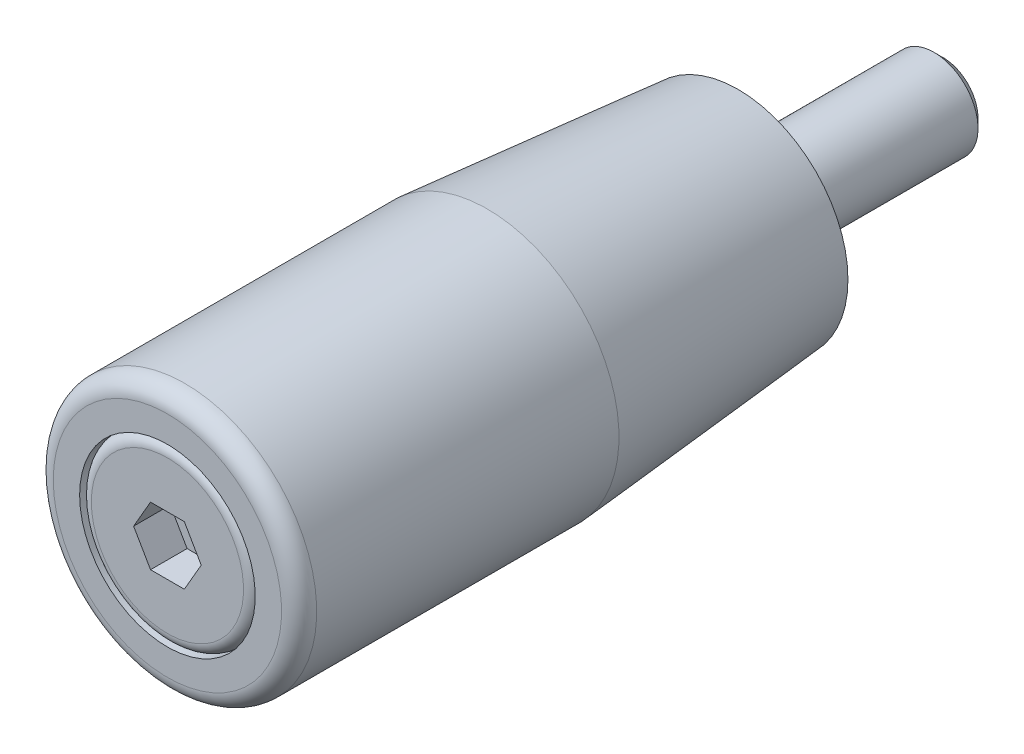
ISO-10303-21;
HEADER;
FILE_DESCRIPTION(('STEP AP214'),'2;1');
FILE_NAME('part.step','',(''),(''),'','','');
FILE_SCHEMA(('AUTOMOTIVE_DESIGN { 1 0 10303 214 1 1 1 1 }'));
ENDSEC;
DATA;
#1=APPLICATION_CONTEXT('core data for automotive mechanical design processes');
#2=APPLICATION_PROTOCOL_DEFINITION('international standard','automotive_design',2000,#1);
#3=PRODUCT_CONTEXT('',#1,'mechanical');
#4=PRODUCT('Part','Part','',(#3));
#5=PRODUCT_RELATED_PRODUCT_CATEGORY('part','',(#4));
#6=PRODUCT_DEFINITION_FORMATION('','',#4);
#7=PRODUCT_DEFINITION_CONTEXT('part definition',#1,'design');
#8=PRODUCT_DEFINITION('design','',#6,#7);
#9=PRODUCT_DEFINITION_SHAPE('','',#8);
#10=(LENGTH_UNIT() NAMED_UNIT(*) SI_UNIT(.MILLI.,.METRE.));
#11=(NAMED_UNIT(*) PLANE_ANGLE_UNIT() SI_UNIT($,.RADIAN.));
#12=(NAMED_UNIT(*) SI_UNIT($,.STERADIAN.) SOLID_ANGLE_UNIT());
#13=UNCERTAINTY_MEASURE_WITH_UNIT(LENGTH_MEASURE(1.E-05),#10,'distance_accuracy_value','');
#14=(GEOMETRIC_REPRESENTATION_CONTEXT(3) GLOBAL_UNCERTAINTY_ASSIGNED_CONTEXT((#13)) GLOBAL_UNIT_ASSIGNED_CONTEXT((#10,
#11,#12)) REPRESENTATION_CONTEXT('',''));
#15=CARTESIAN_POINT('',(0.,0.,0.));
#16=DIRECTION('',(0.,0.,1.));
#17=DIRECTION('',(1.,0.,0.));
#18=AXIS2_PLACEMENT_3D('',#15,#16,#17);
#19=CARTESIAN_POINT('',(0.,-2.,0.));
#20=DIRECTION('',(0.,0.,1.));
#21=DIRECTION('',(-1.,0.,0.));
#22=AXIS2_PLACEMENT_3D('',#19,#20,#21);
#23=PLANE('',#22);
#24=CARTESIAN_POINT('',(0.,0.,0.));
#25=DIRECTION('',(0.,0.,1.));
#26=DIRECTION('',(-1.,0.,0.));
#27=AXIS2_PLACEMENT_3D('',#24,#25,#26);
#28=CIRCLE('',#27,4.);
#29=CARTESIAN_POINT('',(-4.,0.,0.));
#30=VERTEX_POINT('',#29);
#31=EDGE_CURVE('E121',#30,#30,#28,.T.);
#32=ORIENTED_EDGE('',*,*,#31,.F.);
#33=EDGE_LOOP('',(#32));
#34=FACE_BOUND('',#33,.T.);
#35=CARTESIAN_POINT('',(0.,0.,0.));
#36=DIRECTION('',(0.,0.,1.));
#37=DIRECTION('',(-1.,0.,0.));
#38=AXIS2_PLACEMENT_3D('',#35,#36,#37);
#39=CIRCLE('',#38,2.);
#40=CARTESIAN_POINT('',(-2.,0.,0.));
#41=VERTEX_POINT('',#40);
#42=EDGE_CURVE('E124',#41,#41,#39,.T.);
#43=ORIENTED_EDGE('',*,*,#42,.T.);
#44=EDGE_LOOP('',(#43));
#45=FACE_BOUND('',#44,.T.);
#46=ADVANCED_FACE('F15',(#34,#45),#23,.F.);
#47=CARTESIAN_POINT('',(0.,-2.7931850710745E-13,40.));
#48=DIRECTION('',(0.,0.,1.));
#49=DIRECTION('',(-1.,0.,0.));
#50=AXIS2_PLACEMENT_3D('',#47,#48,#49);
#51=CYLINDRICAL_SURFACE('',#50,2.);
#52=ORIENTED_EDGE('',*,*,#42,.F.);
#53=EDGE_LOOP('',(#52));
#54=FACE_BOUND('',#53,.T.);
#55=CARTESIAN_POINT('',(0.,0.,-1.5));
#56=DIRECTION('',(0.,0.,1.));
#57=DIRECTION('',(-1.,0.,0.));
#58=AXIS2_PLACEMENT_3D('',#55,#56,#57);
#59=CIRCLE('',#58,2.);
#60=CARTESIAN_POINT('',(-2.,0.,-1.5));
#61=VERTEX_POINT('',#60);
#62=EDGE_CURVE('E127',#61,#61,#59,.T.);
#63=ORIENTED_EDGE('',*,*,#62,.T.);
#64=EDGE_LOOP('',(#63));
#65=FACE_BOUND('',#64,.T.);
#66=ADVANCED_FACE('F246',(#54,#65),#51,.T.);
#67=CARTESIAN_POINT('',(0.,-2.3865,-1.5));
#68=DIRECTION('',(0.,0.,-1.));
#69=DIRECTION('',(1.,0.,0.));
#70=AXIS2_PLACEMENT_3D('',#67,#68,#69);
#71=PLANE('',#70);
#72=ORIENTED_EDGE('',*,*,#62,.F.);
#73=EDGE_LOOP('',(#72));
#74=FACE_BOUND('',#73,.T.);
#75=CARTESIAN_POINT('',(0.,0.,-1.5));
#76=DIRECTION('',(0.,0.,1.));
#77=DIRECTION('',(-1.,0.,0.));
#78=AXIS2_PLACEMENT_3D('',#75,#76,#77);
#79=CIRCLE('',#78,2.3865);
#80=CARTESIAN_POINT('',(-2.3865,0.,-1.5));
#81=VERTEX_POINT('',#80);
#82=EDGE_CURVE('E130',#81,#81,#79,.T.);
#83=ORIENTED_EDGE('',*,*,#82,.T.);
#84=EDGE_LOOP('',(#83));
#85=FACE_BOUND('',#84,.T.);
#86=ADVANCED_FACE('F242',(#74,#85),#71,.F.);
#87=CARTESIAN_POINT('',(0.,0.,-2.1135));
#88=DIRECTION('',(0.,0.,-1.));
#89=DIRECTION('',(1.,0.,0.));
#90=AXIS2_PLACEMENT_3D('',#87,#88,#89);
#91=CONICAL_SURFACE('',#90,3.,0.785398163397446);
#92=ORIENTED_EDGE('',*,*,#82,.F.);
#93=EDGE_LOOP('',(#92));
#94=FACE_BOUND('',#93,.T.);
#95=CARTESIAN_POINT('',(0.,0.,-2.1135));
#96=DIRECTION('',(0.,0.,1.));
#97=DIRECTION('',(-1.,0.,0.));
#98=AXIS2_PLACEMENT_3D('',#95,#96,#97);
#99=CIRCLE('',#98,3.);
#100=CARTESIAN_POINT('',(-3.,0.,-2.1135));
#101=VERTEX_POINT('',#100);
#102=EDGE_CURVE('E133',#101,#101,#99,.T.);
#103=ORIENTED_EDGE('',*,*,#102,.T.);
#104=EDGE_LOOP('',(#103));
#105=FACE_BOUND('',#104,.T.);
#106=ADVANCED_FACE('F238',(#94,#105),#91,.T.);
#107=CARTESIAN_POINT('',(0.,-2.7931850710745E-13,40.));
#108=DIRECTION('',(0.,0.,1.));
#109=DIRECTION('',(-1.,0.,0.));
#110=AXIS2_PLACEMENT_3D('',#107,#108,#109);
#111=CYLINDRICAL_SURFACE('',#110,3.);
#112=ORIENTED_EDGE('',*,*,#102,.F.);
#113=EDGE_LOOP('',(#112));
#114=FACE_BOUND('',#113,.T.);
#115=CARTESIAN_POINT('',(0.,0.,-12.3865));
#116=DIRECTION('',(0.,0.,1.));
#117=DIRECTION('',(-1.,0.,0.));
#118=AXIS2_PLACEMENT_3D('',#115,#116,#117);
#119=CIRCLE('',#118,3.);
#120=CARTESIAN_POINT('',(-3.,0.,-12.3865));
#121=VERTEX_POINT('',#120);
#122=EDGE_CURVE('E136',#121,#121,#119,.T.);
#123=ORIENTED_EDGE('',*,*,#122,.T.);
#124=EDGE_LOOP('',(#123));
#125=FACE_BOUND('',#124,.T.);
#126=ADVANCED_FACE('F234',(#114,#125),#111,.T.);
#127=CARTESIAN_POINT('',(0.,0.,-13.));
#128=DIRECTION('',(0.,0.,1.));
#129=DIRECTION('',(-1.,0.,0.));
#130=AXIS2_PLACEMENT_3D('',#127,#128,#129);
#131=CONICAL_SURFACE('',#130,2.3865,0.785398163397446);
#132=ORIENTED_EDGE('',*,*,#122,.F.);
#133=EDGE_LOOP('',(#132));
#134=FACE_BOUND('',#133,.T.);
#135=CARTESIAN_POINT('',(0.,0.,-13.));
#136=DIRECTION('',(0.,0.,1.));
#137=DIRECTION('',(-1.,0.,0.));
#138=AXIS2_PLACEMENT_3D('',#135,#136,#137);
#139=CIRCLE('',#138,2.3865);
#140=CARTESIAN_POINT('',(-2.3865,0.,-13.));
#141=VERTEX_POINT('',#140);
#142=EDGE_CURVE('E139',#141,#141,#139,.T.);
#143=ORIENTED_EDGE('',*,*,#142,.T.);
#144=EDGE_LOOP('',(#143));
#145=FACE_BOUND('',#144,.T.);
#146=ADVANCED_FACE('F230',(#134,#145),#131,.T.);
#147=CARTESIAN_POINT('',(0.,0.,-13.));
#148=DIRECTION('',(0.,0.,1.));
#149=DIRECTION('',(-1.,0.,0.));
#150=AXIS2_PLACEMENT_3D('',#147,#148,#149);
#151=PLANE('',#150);
#152=ORIENTED_EDGE('',*,*,#142,.F.);
#153=EDGE_LOOP('',(#152));
#154=FACE_BOUND('',#153,.T.);
#155=ADVANCED_FACE('F202',(#154),#151,.F.);
#156=CARTESIAN_POINT('',(0.,-2.7931850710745E-13,40.));
#157=DIRECTION('',(0.,0.,1.));
#158=DIRECTION('',(-1.,0.,0.));
#159=AXIS2_PLACEMENT_3D('',#156,#157,#158);
#160=CYLINDRICAL_SURFACE('',#159,4.);
#161=CARTESIAN_POINT('',(0.,0.,1.));
#162=DIRECTION('',(0.,0.,-1.));
#163=DIRECTION('',(1.,0.,0.));
#164=AXIS2_PLACEMENT_3D('',#161,#162,#163);
#165=CIRCLE('',#164,4.);
#166=CARTESIAN_POINT('',(4.,0.,1.));
#167=VERTEX_POINT('',#166);
#168=EDGE_CURVE('E9',#167,#167,#165,.T.);
#169=ORIENTED_EDGE('',*,*,#168,.T.);
#170=EDGE_LOOP('',(#169));
#171=FACE_BOUND('',#170,.T.);
#172=ORIENTED_EDGE('',*,*,#31,.T.);
#173=EDGE_LOOP('',(#172));
#174=FACE_BOUND('',#173,.T.);
#175=ADVANCED_FACE('F194',(#171,#174),#160,.T.);
#176=CARTESIAN_POINT('',(0.,-2.7931850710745E-13,40.));
#177=DIRECTION('',(0.,0.,1.));
#178=DIRECTION('',(-1.,0.,0.));
#179=AXIS2_PLACEMENT_3D('',#176,#177,#178);
#180=CYLINDRICAL_SURFACE('',#179,6.);
#181=CARTESIAN_POINT('',(0.,-2.7931850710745E-13,40.));
#182=DIRECTION('',(0.,0.,1.));
#183=DIRECTION('',(-1.,0.,0.));
#184=AXIS2_PLACEMENT_3D('',#181,#182,#183);
#185=CIRCLE('',#184,6.);
#186=CARTESIAN_POINT('',(-6.,-2.7931850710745E-13,40.));
#187=VERTEX_POINT('',#186);
#188=EDGE_CURVE('E167',#187,#187,#185,.T.);
#189=ORIENTED_EDGE('',*,*,#188,.T.);
#190=EDGE_LOOP('',(#189));
#191=FACE_BOUND('',#190,.T.);
#192=CARTESIAN_POINT('',(0.,-2.73732136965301E-13,39.2));
#193=DIRECTION('',(0.,0.,1.));
#194=DIRECTION('',(-1.,0.,0.));
#195=AXIS2_PLACEMENT_3D('',#192,#193,#194);
#196=CIRCLE('',#195,6.);
#197=CARTESIAN_POINT('',(-6.,-2.73732136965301E-13,39.2));
#198=VERTEX_POINT('',#197);
#199=EDGE_CURVE('E112',#198,#198,#196,.T.);
#200=ORIENTED_EDGE('',*,*,#199,.F.);
#201=EDGE_LOOP('',(#200));
#202=FACE_BOUND('',#201,.T.);
#203=ADVANCED_FACE('F180',(#191,#202),#180,.F.);
#204=CARTESIAN_POINT('',(0.,-6.00000000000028,40.));
#205=DIRECTION('',(0.,0.,1.));
#206=DIRECTION('',(-1.,0.,0.));
#207=AXIS2_PLACEMENT_3D('',#204,#205,#206);
#208=PLANE('',#207);
#209=CARTESIAN_POINT('',(0.,-2.7931850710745E-13,40.));
#210=DIRECTION('',(0.,0.,1.));
#211=DIRECTION('',(-1.,0.,0.));
#212=AXIS2_PLACEMENT_3D('',#209,#210,#211);
#213=CIRCLE('',#212,7.8);
#214=CARTESIAN_POINT('',(-7.8,-2.7931850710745E-13,40.));
#215=VERTEX_POINT('',#214);
#216=EDGE_CURVE('E165',#215,#215,#213,.T.);
#217=ORIENTED_EDGE('',*,*,#216,.T.);
#218=EDGE_LOOP('',(#217));
#219=FACE_BOUND('',#218,.T.);
#220=ORIENTED_EDGE('',*,*,#188,.F.);
#221=EDGE_LOOP('',(#220));
#222=FACE_BOUND('',#221,.T.);
#223=ADVANCED_FACE('F211',(#219,#222),#208,.T.);
#224=CARTESIAN_POINT('',(0.,-2.70938951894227E-13,38.8));
#225=DIRECTION('',(0.,0.,1.));
#226=DIRECTION('',(-1.,0.,0.));
#227=AXIS2_PLACEMENT_3D('',#224,#225,#226);
#228=TOROIDAL_SURFACE('',#227,7.8,1.2);
#229=CARTESIAN_POINT('',(0.,-2.70938951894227E-13,38.8));
#230=DIRECTION('',(0.,0.,1.));
#231=DIRECTION('',(-1.,0.,0.));
#232=AXIS2_PLACEMENT_3D('',#229,#230,#231);
#233=CIRCLE('',#232,9.);
#234=CARTESIAN_POINT('',(-9.,-2.70938951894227E-13,38.8));
#235=VERTEX_POINT('',#234);
#236=EDGE_CURVE('E162',#235,#235,#233,.T.);
#237=ORIENTED_EDGE('',*,*,#236,.T.);
#238=EDGE_LOOP('',(#237));
#239=FACE_BOUND('',#238,.T.);
#240=ORIENTED_EDGE('',*,*,#216,.F.);
#241=EDGE_LOOP('',(#240));
#242=FACE_BOUND('',#241,.T.);
#243=ADVANCED_FACE('F214',(#239,#242),#228,.T.);
#244=CARTESIAN_POINT('',(0.,-7.5,0.999999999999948));
#245=DIRECTION('',(0.,0.,-1.));
#246=DIRECTION('',(1.,0.,0.));
#247=AXIS2_PLACEMENT_3D('',#244,#245,#246);
#248=PLANE('',#247);
#249=ORIENTED_EDGE('',*,*,#168,.F.);
#250=EDGE_LOOP('',(#249));
#251=FACE_BOUND('',#250,.T.);
#252=CARTESIAN_POINT('',(0.,0.,1.));
#253=DIRECTION('',(0.,0.,1.));
#254=DIRECTION('',(-1.,0.,0.));
#255=AXIS2_PLACEMENT_3D('',#252,#253,#254);
#256=CIRCLE('',#255,7.5);
#257=CARTESIAN_POINT('',(-7.5,0.,1.));
#258=VERTEX_POINT('',#257);
#259=EDGE_CURVE('E156',#258,#258,#256,.T.);
#260=ORIENTED_EDGE('',*,*,#259,.F.);
#261=EDGE_LOOP('',(#260));
#262=FACE_BOUND('',#261,.T.);
#263=ADVANCED_FACE('F17',(#251,#262),#248,.T.);
#264=CARTESIAN_POINT('',(0.,-1.26706405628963E-13,18.145078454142));
#265=DIRECTION('',(0.,0.,1.));
#266=DIRECTION('',(-1.,0.,0.));
#267=AXIS2_PLACEMENT_3D('',#264,#265,#266);
#268=CONICAL_SURFACE('',#267,9.,0.0872664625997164);
#269=ORIENTED_EDGE('',*,*,#259,.T.);
#270=EDGE_LOOP('',(#269));
#271=FACE_BOUND('',#270,.T.);
#272=CARTESIAN_POINT('',(0.,-1.26706405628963E-13,18.145078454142));
#273=DIRECTION('',(0.,0.,1.));
#274=DIRECTION('',(-1.,0.,0.));
#275=AXIS2_PLACEMENT_3D('',#272,#273,#274);
#276=CIRCLE('',#275,9.);
#277=CARTESIAN_POINT('',(-9.,-1.26706405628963E-13,18.145078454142));
#278=VERTEX_POINT('',#277);
#279=EDGE_CURVE('E159',#278,#278,#276,.T.);
#280=ORIENTED_EDGE('',*,*,#279,.F.);
#281=EDGE_LOOP('',(#280));
#282=FACE_BOUND('',#281,.T.);
#283=ADVANCED_FACE('F223',(#271,#282),#268,.T.);
#284=CARTESIAN_POINT('',(0.,-2.7931850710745E-13,40.));
#285=DIRECTION('',(0.,0.,1.));
#286=DIRECTION('',(-1.,0.,0.));
#287=AXIS2_PLACEMENT_3D('',#284,#285,#286);
#288=CYLINDRICAL_SURFACE('',#287,9.);
#289=ORIENTED_EDGE('',*,*,#279,.T.);
#290=EDGE_LOOP('',(#289));
#291=FACE_BOUND('',#290,.T.);
#292=ORIENTED_EDGE('',*,*,#236,.F.);
#293=EDGE_LOOP('',(#292));
#294=FACE_BOUND('',#293,.T.);
#295=ADVANCED_FACE('F219',(#291,#294),#288,.T.);
#296=CARTESIAN_POINT('',(0.,-2.73732136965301E-13,39.2));
#297=DIRECTION('',(0.,0.,1.));
#298=DIRECTION('',(-1.,0.,0.));
#299=AXIS2_PLACEMENT_3D('',#296,#297,#298);
#300=TOROIDAL_SURFACE('',#299,5.2,0.799999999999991);
#301=ORIENTED_EDGE('',*,*,#199,.T.);
#302=EDGE_LOOP('',(#301));
#303=FACE_BOUND('',#302,.T.);
#304=CARTESIAN_POINT('',(0.,-2.7931850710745E-13,40.));
#305=DIRECTION('',(0.,0.,1.));
#306=DIRECTION('',(-1.,0.,0.));
#307=AXIS2_PLACEMENT_3D('',#304,#305,#306);
#308=CIRCLE('',#307,5.2);
#309=CARTESIAN_POINT('',(-5.2,-2.7931850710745E-13,40.));
#310=VERTEX_POINT('',#309);
#311=EDGE_CURVE('E85',#310,#310,#308,.T.);
#312=ORIENTED_EDGE('',*,*,#311,.F.);
#313=EDGE_LOOP('',(#312));
#314=FACE_BOUND('',#313,.T.);
#315=ADVANCED_FACE('F222',(#303,#314),#300,.T.);
#316=CARTESIAN_POINT('',(0.,-5.20000000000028,40.));
#317=DIRECTION('',(0.,0.,-1.));
#318=DIRECTION('',(1.,0.,0.));
#319=AXIS2_PLACEMENT_3D('',#316,#317,#318);
#320=PLANE('',#319);
#321=DIRECTION('',(1.,0.,0.));
#322=VECTOR('',#321,1.);
#323=CARTESIAN_POINT('',(0.,-2.00000000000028,40.));
#324=LINE('',#323,#322);
#325=CARTESIAN_POINT('',(-1.15470053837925,-2.00000000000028,40.));
#326=VERTEX_POINT('',#325);
#327=CARTESIAN_POINT('',(1.15470053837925,-2.00000000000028,40.));
#328=VERTEX_POINT('',#327);
#329=EDGE_CURVE('E146',#326,#328,#324,.T.);
#330=ORIENTED_EDGE('',*,*,#329,.F.);
#331=DIRECTION('',(0.5,-0.866025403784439,0.));
#332=VECTOR('',#331,1.);
#333=CARTESIAN_POINT('',(0.519615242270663,-4.90000000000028,40.));
#334=LINE('',#333,#332);
#335=CARTESIAN_POINT('',(-2.30940107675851,-2.7931850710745E-13,40.));
#336=VERTEX_POINT('',#335);
#337=EDGE_CURVE('E148',#336,#326,#334,.T.);
#338=ORIENTED_EDGE('',*,*,#337,.F.);
#339=DIRECTION('',(-0.5,-0.866025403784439,0.));
#340=VECTOR('',#339,1.);
#341=CARTESIAN_POINT('',(-3.98371685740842,-2.90000000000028,40.));
#342=LINE('',#341,#340);
#343=CARTESIAN_POINT('',(-1.15470053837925,1.99999999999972,40.));
#344=VERTEX_POINT('',#343);
#345=EDGE_CURVE('E151',#344,#336,#342,.T.);
#346=ORIENTED_EDGE('',*,*,#345,.F.);
#347=DIRECTION('',(-1.,0.,0.));
#348=VECTOR('',#347,1.);
#349=CARTESIAN_POINT('',(0.,1.99999999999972,40.));
#350=LINE('',#349,#348);
#351=CARTESIAN_POINT('',(1.15470053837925,1.99999999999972,40.));
#352=VERTEX_POINT('',#351);
#353=EDGE_CURVE('E41',#352,#344,#350,.T.);
#354=ORIENTED_EDGE('',*,*,#353,.F.);
#355=DIRECTION('',(-0.5,0.866025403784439,0.));
#356=VECTOR('',#355,1.);
#357=CARTESIAN_POINT('',(3.98371685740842,-2.90000000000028,40.));
#358=LINE('',#357,#356);
#359=CARTESIAN_POINT('',(2.30940107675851,-2.7931850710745E-13,40.));
#360=VERTEX_POINT('',#359);
#361=EDGE_CURVE('E142',#360,#352,#358,.T.);
#362=ORIENTED_EDGE('',*,*,#361,.F.);
#363=DIRECTION('',(0.5,0.866025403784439,0.));
#364=VECTOR('',#363,1.);
#365=CARTESIAN_POINT('',(-0.519615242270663,-4.90000000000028,40.));
#366=LINE('',#365,#364);
#367=EDGE_CURVE('E144',#328,#360,#366,.T.);
#368=ORIENTED_EDGE('',*,*,#367,.F.);
#369=EDGE_LOOP('',(#330,#338,#346,#354,#362,#368));
#370=FACE_BOUND('',#369,.T.);
#371=ORIENTED_EDGE('',*,*,#311,.T.);
#372=EDGE_LOOP('',(#371));
#373=FACE_BOUND('',#372,.T.);
#374=ADVANCED_FACE('F273',(#370,#373),#320,.F.);
#375=CARTESIAN_POINT('',(-1.15470053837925,-2.00000000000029,42.5));
#376=DIRECTION('',(0.,1.,0.));
#377=DIRECTION('',(-1.,0.,0.));
#378=AXIS2_PLACEMENT_3D('',#375,#376,#377);
#379=PLANE('',#378);
#380=DIRECTION('',(0.,0.,-1.));
#381=VECTOR('',#380,1.);
#382=CARTESIAN_POINT('',(-1.15470053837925,-2.00000000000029,42.5));
#383=LINE('',#382,#381);
#384=CARTESIAN_POINT('',(-1.15470053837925,-2.00000000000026,37.5));
#385=VERTEX_POINT('',#384);
#386=EDGE_CURVE('E106',#326,#385,#383,.T.);
#387=ORIENTED_EDGE('',*,*,#386,.F.);
#388=ORIENTED_EDGE('',*,*,#329,.T.);
#389=DIRECTION('',(0.,0.,-1.));
#390=VECTOR('',#389,1.);
#391=CARTESIAN_POINT('',(1.15470053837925,-2.00000000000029,42.5));
#392=LINE('',#391,#390);
#393=CARTESIAN_POINT('',(1.15470053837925,-2.00000000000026,37.5));
#394=VERTEX_POINT('',#393);
#395=EDGE_CURVE('E103',#328,#394,#392,.T.);
#396=ORIENTED_EDGE('',*,*,#395,.T.);
#397=DIRECTION('',(1.,0.,0.));
#398=VECTOR('',#397,1.);
#399=CARTESIAN_POINT('',(-1.15470053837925,-2.00000000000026,37.5));
#400=LINE('',#399,#398);
#401=EDGE_CURVE('E93',#385,#394,#400,.T.);
#402=ORIENTED_EDGE('',*,*,#401,.F.);
#403=EDGE_LOOP('',(#387,#388,#396,#402));
#404=FACE_BOUND('',#403,.T.);
#405=ADVANCED_FACE('F269',(#404),#379,.T.);
#406=CARTESIAN_POINT('',(-2.30940107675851,-2.96775913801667E-13,42.5));
#407=DIRECTION('',(0.866025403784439,0.5,0.));
#408=DIRECTION('',(-0.5,0.866025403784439,0.));
#409=AXIS2_PLACEMENT_3D('',#406,#407,#408);
#410=PLANE('',#409);
#411=ORIENTED_EDGE('',*,*,#337,.T.);
#412=ORIENTED_EDGE('',*,*,#386,.T.);
#413=DIRECTION('',(0.5,-0.866025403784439,0.));
#414=VECTOR('',#413,1.);
#415=CARTESIAN_POINT('',(-2.30940107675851,-2.61861100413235E-13,37.5));
#416=LINE('',#415,#414);
#417=CARTESIAN_POINT('',(-2.30940107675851,-2.61861100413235E-13,37.5));
#418=VERTEX_POINT('',#417);
#419=EDGE_CURVE('E91',#418,#385,#416,.T.);
#420=ORIENTED_EDGE('',*,*,#419,.F.);
#421=DIRECTION('',(0.,0.,-1.));
#422=VECTOR('',#421,1.);
#423=CARTESIAN_POINT('',(-2.30940107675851,-2.96775913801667E-13,42.5));
#424=LINE('',#423,#422);
#425=EDGE_CURVE('E86',#336,#418,#424,.T.);
#426=ORIENTED_EDGE('',*,*,#425,.F.);
#427=EDGE_LOOP('',(#411,#412,#420,#426));
#428=FACE_BOUND('',#427,.T.);
#429=ADVANCED_FACE('F272',(#428),#410,.T.);
#430=CARTESIAN_POINT('',(-1.15470053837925,1.99999999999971,42.5));
#431=DIRECTION('',(0.866025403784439,-0.5,0.));
#432=DIRECTION('',(0.5,0.866025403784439,0.));
#433=AXIS2_PLACEMENT_3D('',#430,#431,#432);
#434=PLANE('',#433);
#435=ORIENTED_EDGE('',*,*,#345,.T.);
#436=ORIENTED_EDGE('',*,*,#425,.T.);
#437=DIRECTION('',(-0.5,-0.866025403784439,0.));
#438=VECTOR('',#437,1.);
#439=CARTESIAN_POINT('',(-1.15470053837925,1.99999999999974,37.5));
#440=LINE('',#439,#438);
#441=CARTESIAN_POINT('',(-1.15470053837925,1.99999999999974,37.5));
#442=VERTEX_POINT('',#441);
#443=EDGE_CURVE('E76',#442,#418,#440,.T.);
#444=ORIENTED_EDGE('',*,*,#443,.F.);
#445=DIRECTION('',(0.,0.,-1.));
#446=VECTOR('',#445,1.);
#447=CARTESIAN_POINT('',(-1.15470053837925,1.99999999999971,42.5));
#448=LINE('',#447,#446);
#449=EDGE_CURVE('E81',#344,#442,#448,.T.);
#450=ORIENTED_EDGE('',*,*,#449,.F.);
#451=EDGE_LOOP('',(#435,#436,#444,#450));
#452=FACE_BOUND('',#451,.T.);
#453=ADVANCED_FACE('F88',(#452),#434,.T.);
#454=CARTESIAN_POINT('',(1.15470053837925,1.99999999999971,42.5));
#455=DIRECTION('',(0.,-1.,0.));
#456=DIRECTION('',(1.,0.,0.));
#457=AXIS2_PLACEMENT_3D('',#454,#455,#456);
#458=PLANE('',#457);
#459=ORIENTED_EDGE('',*,*,#353,.T.);
#460=ORIENTED_EDGE('',*,*,#449,.T.);
#461=DIRECTION('',(-1.,0.,0.));
#462=VECTOR('',#461,1.);
#463=CARTESIAN_POINT('',(1.15470053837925,1.99999999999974,37.5));
#464=LINE('',#463,#462);
#465=CARTESIAN_POINT('',(1.15470053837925,1.99999999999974,37.5));
#466=VERTEX_POINT('',#465);
#467=EDGE_CURVE('E73',#466,#442,#464,.T.);
#468=ORIENTED_EDGE('',*,*,#467,.F.);
#469=DIRECTION('',(0.,0.,-1.));
#470=VECTOR('',#469,1.);
#471=CARTESIAN_POINT('',(1.15470053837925,1.99999999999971,42.5));
#472=LINE('',#471,#470);
#473=EDGE_CURVE('E100',#352,#466,#472,.T.);
#474=ORIENTED_EDGE('',*,*,#473,.F.);
#475=EDGE_LOOP('',(#459,#460,#468,#474));
#476=FACE_BOUND('',#475,.T.);
#477=ADVANCED_FACE('F82',(#476),#458,.T.);
#478=CARTESIAN_POINT('',(2.30940107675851,-2.96775913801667E-13,42.5));
#479=DIRECTION('',(-0.866025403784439,-0.5,0.));
#480=DIRECTION('',(0.5,-0.866025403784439,0.));
#481=AXIS2_PLACEMENT_3D('',#478,#479,#480);
#482=PLANE('',#481);
#483=ORIENTED_EDGE('',*,*,#361,.T.);
#484=ORIENTED_EDGE('',*,*,#473,.T.);
#485=DIRECTION('',(-0.5,0.866025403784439,0.));
#486=VECTOR('',#485,1.);
#487=CARTESIAN_POINT('',(2.30940107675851,-2.61861100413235E-13,37.5));
#488=LINE('',#487,#486);
#489=CARTESIAN_POINT('',(2.30940107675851,-2.61861100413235E-13,37.5));
#490=VERTEX_POINT('',#489);
#491=EDGE_CURVE('E78',#490,#466,#488,.T.);
#492=ORIENTED_EDGE('',*,*,#491,.F.);
#493=DIRECTION('',(0.,0.,-1.));
#494=VECTOR('',#493,1.);
#495=CARTESIAN_POINT('',(2.30940107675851,-2.96775913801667E-13,42.5));
#496=LINE('',#495,#494);
#497=EDGE_CURVE('E33',#360,#490,#496,.T.);
#498=ORIENTED_EDGE('',*,*,#497,.F.);
#499=EDGE_LOOP('',(#483,#484,#492,#498));
#500=FACE_BOUND('',#499,.T.);
#501=ADVANCED_FACE('F263',(#500),#482,.T.);
#502=CARTESIAN_POINT('',(1.15470053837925,-2.00000000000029,42.5));
#503=DIRECTION('',(-0.866025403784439,0.5,0.));
#504=DIRECTION('',(-0.5,-0.866025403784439,0.));
#505=AXIS2_PLACEMENT_3D('',#502,#503,#504);
#506=PLANE('',#505);
#507=ORIENTED_EDGE('',*,*,#367,.T.);
#508=ORIENTED_EDGE('',*,*,#497,.T.);
#509=DIRECTION('',(0.5,0.866025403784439,0.));
#510=VECTOR('',#509,1.);
#511=CARTESIAN_POINT('',(1.15470053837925,-2.00000000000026,37.5));
#512=LINE('',#511,#510);
#513=EDGE_CURVE('E97',#394,#490,#512,.T.);
#514=ORIENTED_EDGE('',*,*,#513,.F.);
#515=ORIENTED_EDGE('',*,*,#395,.F.);
#516=EDGE_LOOP('',(#507,#508,#514,#515));
#517=FACE_BOUND('',#516,.T.);
#518=ADVANCED_FACE('F257',(#517),#506,.T.);
#519=CARTESIAN_POINT('',(0.,-2.61861100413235E-13,37.5));
#520=DIRECTION('',(0.,0.,1.));
#521=DIRECTION('',(-1.,0.,0.));
#522=AXIS2_PLACEMENT_3D('',#519,#520,#521);
#523=PLANE('',#522);
#524=ORIENTED_EDGE('',*,*,#419,.T.);
#525=ORIENTED_EDGE('',*,*,#401,.T.);
#526=ORIENTED_EDGE('',*,*,#513,.T.);
#527=ORIENTED_EDGE('',*,*,#491,.T.);
#528=ORIENTED_EDGE('',*,*,#467,.T.);
#529=ORIENTED_EDGE('',*,*,#443,.T.);
#530=EDGE_LOOP('',(#524,#525,#526,#527,#528,#529));
#531=FACE_BOUND('',#530,.T.);
#532=ADVANCED_FACE('F74',(#531),#523,.T.);
#533=CLOSED_SHELL('',(#46,#66,#86,#106,#126,#146,#155,#175,#203,#223,#243,#263,#283,#295,#315,
#374,#405,#429,#453,#477,#501,#518,#532));
#534=CARTESIAN_POINT('',(0.,-2.51386656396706E-13,36.));
#535=DIRECTION('',(0.,0.,1.));
#536=DIRECTION('',(-1.,0.,0.));
#537=AXIS2_PLACEMENT_3D('',#534,#535,#536);
#538=CIRCLE('',#537,4.);
#539=CARTESIAN_POINT('',(-4.,-2.51386656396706E-13,36.));
#540=VERTEX_POINT('',#539);
#541=EDGE_CURVE('E25',#540,#540,#538,.T.);
#542=ORIENTED_EDGE('',*,*,#541,.T.);
#543=EDGE_LOOP('',(#542));
#544=FACE_BOUND('',#543,.T.);
#545=CARTESIAN_POINT('',(0.,-2.60464507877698E-13,37.3));
#546=DIRECTION('',(0.,0.,1.));
#547=DIRECTION('',(-1.,0.,0.));
#548=AXIS2_PLACEMENT_3D('',#545,#546,#547);
#549=CIRCLE('',#548,4.);
#550=CARTESIAN_POINT('',(-4.,-2.60464507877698E-13,37.3));
#551=VERTEX_POINT('',#550);
#552=EDGE_CURVE('E118',#551,#551,#549,.T.);
#553=ORIENTED_EDGE('',*,*,#552,.F.);
#554=EDGE_LOOP('',(#553));
#555=FACE_BOUND('',#554,.T.);
#556=ADVANCED_FACE('F181',(#544,#555),#160,.T.);
#557=CARTESIAN_POINT('',(0.,-4.00000000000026,37.3));
#558=DIRECTION('',(0.,0.,1.));
#559=DIRECTION('',(-1.,0.,0.));
#560=AXIS2_PLACEMENT_3D('',#557,#558,#559);
#561=PLANE('',#560);
#562=CARTESIAN_POINT('',(0.,-2.60464507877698E-13,37.3));
#563=DIRECTION('',(0.,0.,1.));
#564=DIRECTION('',(-1.,0.,0.));
#565=AXIS2_PLACEMENT_3D('',#562,#563,#564);
#566=CIRCLE('',#565,6.);
#567=CARTESIAN_POINT('',(-6.,-2.60464507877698E-13,37.3));
#568=VERTEX_POINT('',#567);
#569=EDGE_CURVE('E115',#568,#568,#566,.T.);
#570=ORIENTED_EDGE('',*,*,#569,.F.);
#571=EDGE_LOOP('',(#570));
#572=FACE_BOUND('',#571,.T.);
#573=ORIENTED_EDGE('',*,*,#552,.T.);
#574=EDGE_LOOP('',(#573));
#575=FACE_BOUND('',#574,.T.);
#576=ADVANCED_FACE('F185',(#572,#575),#561,.F.);
#577=CARTESIAN_POINT('',(0.,-4.00000000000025,36.));
#578=DIRECTION('',(0.,0.,1.));
#579=DIRECTION('',(-1.,0.,0.));
#580=AXIS2_PLACEMENT_3D('',#577,#578,#579);
#581=PLANE('',#580);
#582=ORIENTED_EDGE('',*,*,#541,.F.);
#583=EDGE_LOOP('',(#582));
#584=FACE_BOUND('',#583,.T.);
#585=CARTESIAN_POINT('',(0.,-2.51386656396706E-13,36.));
#586=DIRECTION('',(0.,0.,1.));
#587=DIRECTION('',(-1.,0.,0.));
#588=AXIS2_PLACEMENT_3D('',#585,#586,#587);
#589=CIRCLE('',#588,6.);
#590=CARTESIAN_POINT('',(-6.,-2.51386656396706E-13,36.));
#591=VERTEX_POINT('',#590);
#592=EDGE_CURVE('E19',#591,#591,#589,.T.);
#593=ORIENTED_EDGE('',*,*,#592,.T.);
#594=EDGE_LOOP('',(#593));
#595=FACE_BOUND('',#594,.T.);
#596=ADVANCED_FACE('F174',(#584,#595),#581,.T.);
#597=ORIENTED_EDGE('',*,*,#592,.F.);
#598=EDGE_LOOP('',(#597));
#599=FACE_BOUND('',#598,.T.);
#600=ORIENTED_EDGE('',*,*,#569,.T.);
#601=EDGE_LOOP('',(#600));
#602=FACE_BOUND('',#601,.T.);
#603=ADVANCED_FACE('F176',(#599,#602),#180,.F.);
#604=CLOSED_SHELL('',(#556,#576,#596,#603));
#605=ORIENTED_CLOSED_SHELL('',*,#604,.T.);
#606=BREP_WITH_VOIDS('B1',#533,(#605));
#607=ADVANCED_BREP_SHAPE_REPRESENTATION('',(#18,#606),#14);
#608=SHAPE_DEFINITION_REPRESENTATION(#9,#607);
ENDSEC;
END-ISO-10303-21;
